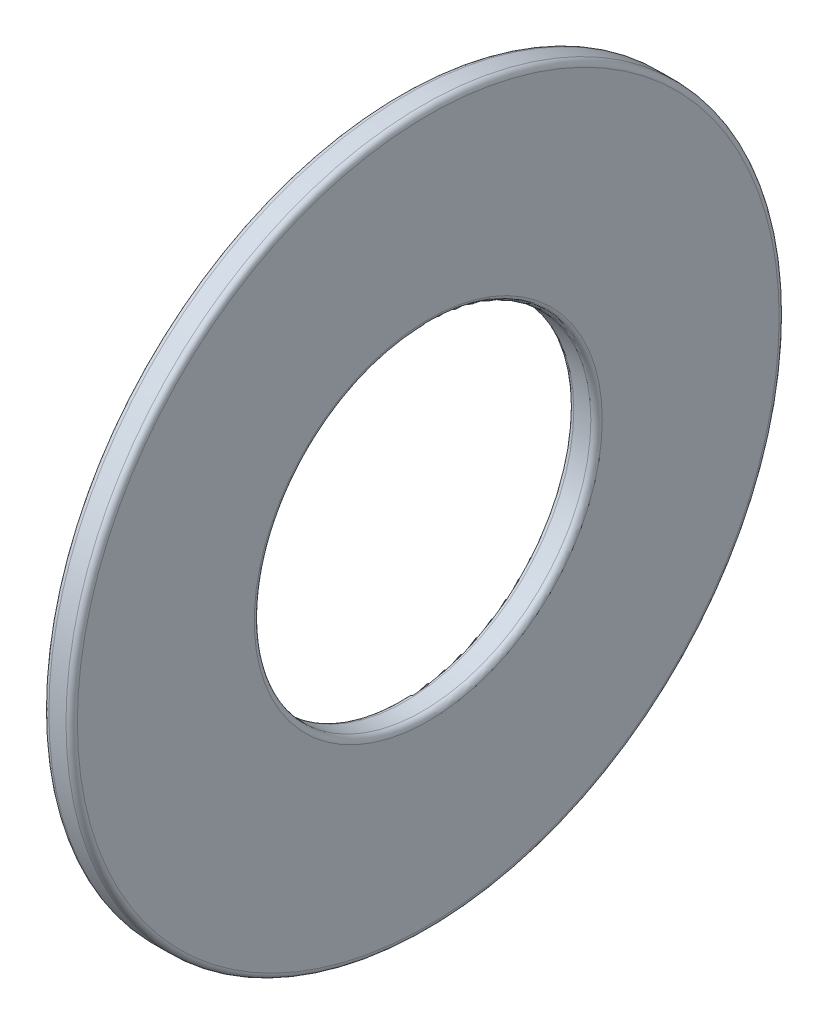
ISO-10303-21;
HEADER;
FILE_DESCRIPTION(('STEP AP214'),'2;1');
FILE_NAME('part.step','',(''),(''),'','','');
FILE_SCHEMA(('AUTOMOTIVE_DESIGN { 1 0 10303 214 1 1 1 1 }'));
ENDSEC;
DATA;
#1=APPLICATION_CONTEXT('core data for automotive mechanical design processes');
#2=APPLICATION_PROTOCOL_DEFINITION('international standard','automotive_design',2000,#1);
#3=PRODUCT_CONTEXT('',#1,'mechanical');
#4=PRODUCT('Part','Part','',(#3));
#5=PRODUCT_RELATED_PRODUCT_CATEGORY('part','',(#4));
#6=PRODUCT_DEFINITION_FORMATION('','',#4);
#7=PRODUCT_DEFINITION_CONTEXT('part definition',#1,'design');
#8=PRODUCT_DEFINITION('design','',#6,#7);
#9=PRODUCT_DEFINITION_SHAPE('','',#8);
#10=(LENGTH_UNIT() NAMED_UNIT(*) SI_UNIT(.MILLI.,.METRE.));
#11=(NAMED_UNIT(*) PLANE_ANGLE_UNIT() SI_UNIT($,.RADIAN.));
#12=(NAMED_UNIT(*) SI_UNIT($,.STERADIAN.) SOLID_ANGLE_UNIT());
#13=UNCERTAINTY_MEASURE_WITH_UNIT(LENGTH_MEASURE(1.E-05),#10,'distance_accuracy_value','');
#14=(GEOMETRIC_REPRESENTATION_CONTEXT(3) GLOBAL_UNCERTAINTY_ASSIGNED_CONTEXT((#13)) GLOBAL_UNIT_ASSIGNED_CONTEXT((#10,
#11,#12)) REPRESENTATION_CONTEXT('',''));
#15=CARTESIAN_POINT('',(0.,0.,0.));
#16=DIRECTION('',(0.,0.,1.));
#17=DIRECTION('',(1.,0.,0.));
#18=AXIS2_PLACEMENT_3D('',#15,#16,#17);
#19=CARTESIAN_POINT('',(1.143,0.,0.));
#20=DIRECTION('',(1.,0.,0.));
#21=DIRECTION('',(0.,0.,-1.));
#22=AXIS2_PLACEMENT_3D('',#19,#20,#21);
#23=PLANE('',#22);
#24=CARTESIAN_POINT('',(1.143,0.,0.));
#25=DIRECTION('',(1.,0.,0.));
#26=DIRECTION('',(0.,0.,-1.));
#27=AXIS2_PLACEMENT_3D('',#24,#25,#26);
#28=CIRCLE('',#27,28.1178);
#29=CARTESIAN_POINT('',(1.143,0.,-28.1178));
#30=VERTEX_POINT('',#29);
#31=EDGE_CURVE('E79',#30,#30,#28,.T.);
#32=ORIENTED_EDGE('',*,*,#31,.T.);
#33=EDGE_LOOP('',(#32));
#34=FACE_BOUND('',#33,.T.);
#35=CARTESIAN_POINT('',(1.143,0.,0.));
#36=DIRECTION('',(1.,0.,0.));
#37=DIRECTION('',(0.,0.,-1.));
#38=AXIS2_PLACEMENT_3D('',#35,#36,#37);
#39=CIRCLE('',#38,13.9446);
#40=CARTESIAN_POINT('',(1.143,0.,-13.9446));
#41=VERTEX_POINT('',#40);
#42=EDGE_CURVE('E84',#41,#41,#39,.F.);
#43=ORIENTED_EDGE('',*,*,#42,.T.);
#44=EDGE_LOOP('',(#43));
#45=FACE_BOUND('',#44,.T.);
#46=ADVANCED_FACE('F44',(#34,#45),#23,.T.);
#47=CARTESIAN_POINT('',(-1.143,0.,0.));
#48=DIRECTION('',(1.,0.,0.));
#49=DIRECTION('',(0.,0.,-1.));
#50=AXIS2_PLACEMENT_3D('',#47,#48,#49);
#51=PLANE('',#50);
#52=CARTESIAN_POINT('',(-1.143,0.,0.));
#53=DIRECTION('',(1.,0.,0.));
#54=DIRECTION('',(0.,0.,-1.));
#55=AXIS2_PLACEMENT_3D('',#52,#53,#54);
#56=CIRCLE('',#55,28.1178);
#57=CARTESIAN_POINT('',(-1.143,0.,-28.1178));
#58=VERTEX_POINT('',#57);
#59=EDGE_CURVE('E56',#58,#58,#56,.F.);
#60=ORIENTED_EDGE('',*,*,#59,.T.);
#61=EDGE_LOOP('',(#60));
#62=FACE_BOUND('',#61,.T.);
#63=CARTESIAN_POINT('',(-1.143,0.,0.));
#64=DIRECTION('',(1.,0.,0.));
#65=DIRECTION('',(0.,0.,-1.));
#66=AXIS2_PLACEMENT_3D('',#63,#64,#65);
#67=CIRCLE('',#66,13.9446);
#68=CARTESIAN_POINT('',(-1.143,0.,-13.9446));
#69=VERTEX_POINT('',#68);
#70=EDGE_CURVE('E63',#69,#69,#67,.T.);
#71=ORIENTED_EDGE('',*,*,#70,.T.);
#72=EDGE_LOOP('',(#71));
#73=FACE_BOUND('',#72,.T.);
#74=ADVANCED_FACE('F101',(#62,#73),#51,.F.);
#75=CARTESIAN_POINT('',(1.143,0.,0.));
#76=DIRECTION('',(-1.,0.,0.));
#77=DIRECTION('',(0.,0.,1.));
#78=AXIS2_PLACEMENT_3D('',#75,#76,#77);
#79=CYLINDRICAL_SURFACE('',#78,28.575);
#80=CARTESIAN_POINT('',(0.6858,0.,0.));
#81=DIRECTION('',(1.,0.,0.));
#82=DIRECTION('',(0.,0.,-1.));
#83=AXIS2_PLACEMENT_3D('',#80,#81,#82);
#84=CIRCLE('',#83,28.575);
#85=CARTESIAN_POINT('',(0.6858,0.,-28.575));
#86=VERTEX_POINT('',#85);
#87=EDGE_CURVE('E72',#86,#86,#84,.F.);
#88=ORIENTED_EDGE('',*,*,#87,.T.);
#89=EDGE_LOOP('',(#88));
#90=FACE_BOUND('',#89,.T.);
#91=CARTESIAN_POINT('',(-0.6858,0.,0.));
#92=DIRECTION('',(1.,0.,0.));
#93=DIRECTION('',(0.,0.,-1.));
#94=AXIS2_PLACEMENT_3D('',#91,#92,#93);
#95=CIRCLE('',#94,28.575);
#96=CARTESIAN_POINT('',(-0.6858,0.,-28.575));
#97=VERTEX_POINT('',#96);
#98=EDGE_CURVE('E73',#97,#97,#95,.T.);
#99=ORIENTED_EDGE('',*,*,#98,.T.);
#100=EDGE_LOOP('',(#99));
#101=FACE_BOUND('',#100,.T.);
#102=ADVANCED_FACE('F107',(#90,#101),#79,.T.);
#103=CARTESIAN_POINT('',(1.143,0.,0.));
#104=DIRECTION('',(-1.,0.,0.));
#105=DIRECTION('',(0.,0.,1.));
#106=AXIS2_PLACEMENT_3D('',#103,#104,#105);
#107=CYLINDRICAL_SURFACE('',#106,13.4874);
#108=CARTESIAN_POINT('',(0.6858,0.,0.));
#109=DIRECTION('',(1.,0.,0.));
#110=DIRECTION('',(0.,0.,-1.));
#111=AXIS2_PLACEMENT_3D('',#108,#109,#110);
#112=CIRCLE('',#111,13.4874);
#113=CARTESIAN_POINT('',(0.6858,0.,-13.4874));
#114=VERTEX_POINT('',#113);
#115=EDGE_CURVE('E10',#114,#114,#112,.T.);
#116=ORIENTED_EDGE('',*,*,#115,.T.);
#117=EDGE_LOOP('',(#116));
#118=FACE_BOUND('',#117,.T.);
#119=CARTESIAN_POINT('',(-0.6858,0.,0.));
#120=DIRECTION('',(1.,0.,0.));
#121=DIRECTION('',(0.,0.,-1.));
#122=AXIS2_PLACEMENT_3D('',#119,#120,#121);
#123=CIRCLE('',#122,13.4874);
#124=CARTESIAN_POINT('',(-0.6858,0.,-13.4874));
#125=VERTEX_POINT('',#124);
#126=EDGE_CURVE('E52',#125,#125,#123,.F.);
#127=ORIENTED_EDGE('',*,*,#126,.T.);
#128=EDGE_LOOP('',(#127));
#129=FACE_BOUND('',#128,.T.);
#130=ADVANCED_FACE('F113',(#118,#129),#107,.F.);
#131=CARTESIAN_POINT('',(0.6858,0.,0.));
#132=DIRECTION('',(1.,0.,0.));
#133=DIRECTION('',(0.,0.,-1.));
#134=AXIS2_PLACEMENT_3D('',#131,#132,#133);
#135=TOROIDAL_SURFACE('',#134,28.1178,0.4572);
#136=ORIENTED_EDGE('',*,*,#87,.F.);
#137=EDGE_LOOP('',(#136));
#138=FACE_BOUND('',#137,.T.);
#139=ORIENTED_EDGE('',*,*,#31,.F.);
#140=EDGE_LOOP('',(#139));
#141=FACE_BOUND('',#140,.T.);
#142=ADVANCED_FACE('F100',(#138,#141),#135,.T.);
#143=CARTESIAN_POINT('',(-0.6858,0.,0.));
#144=DIRECTION('',(1.,0.,0.));
#145=DIRECTION('',(0.,0.,-1.));
#146=AXIS2_PLACEMENT_3D('',#143,#144,#145);
#147=TOROIDAL_SURFACE('',#146,28.1178,0.4572);
#148=ORIENTED_EDGE('',*,*,#59,.F.);
#149=EDGE_LOOP('',(#148));
#150=FACE_BOUND('',#149,.T.);
#151=ORIENTED_EDGE('',*,*,#98,.F.);
#152=EDGE_LOOP('',(#151));
#153=FACE_BOUND('',#152,.T.);
#154=ADVANCED_FACE('F93',(#150,#153),#147,.T.);
#155=CARTESIAN_POINT('',(0.6858,0.,0.));
#156=DIRECTION('',(1.,0.,0.));
#157=DIRECTION('',(0.,0.,-1.));
#158=AXIS2_PLACEMENT_3D('',#155,#156,#157);
#159=TOROIDAL_SURFACE('',#158,13.9446,0.4572);
#160=ORIENTED_EDGE('',*,*,#42,.F.);
#161=EDGE_LOOP('',(#160));
#162=FACE_BOUND('',#161,.T.);
#163=ORIENTED_EDGE('',*,*,#115,.F.);
#164=EDGE_LOOP('',(#163));
#165=FACE_BOUND('',#164,.T.);
#166=ADVANCED_FACE('F87',(#162,#165),#159,.T.);
#167=CARTESIAN_POINT('',(-0.6858,0.,0.));
#168=DIRECTION('',(1.,0.,0.));
#169=DIRECTION('',(0.,0.,-1.));
#170=AXIS2_PLACEMENT_3D('',#167,#168,#169);
#171=TOROIDAL_SURFACE('',#170,13.9446,0.4572);
#172=ORIENTED_EDGE('',*,*,#126,.F.);
#173=EDGE_LOOP('',(#172));
#174=FACE_BOUND('',#173,.T.);
#175=ORIENTED_EDGE('',*,*,#70,.F.);
#176=EDGE_LOOP('',(#175));
#177=FACE_BOUND('',#176,.T.);
#178=ADVANCED_FACE('F50',(#174,#177),#171,.T.);
#179=CLOSED_SHELL('',(#46,#74,#102,#130,#142,#154,#166,#178));
#180=MANIFOLD_SOLID_BREP('B2',#179);
#181=ADVANCED_BREP_SHAPE_REPRESENTATION('',(#18,#180),#14);
#182=SHAPE_DEFINITION_REPRESENTATION(#9,#181);
ENDSEC;
END-ISO-10303-21;
